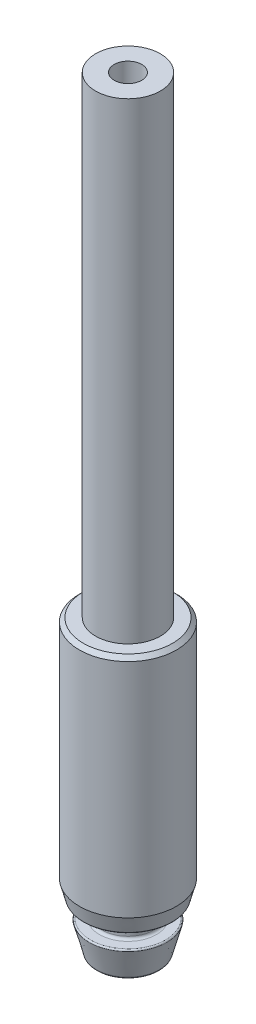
from build123d import *

# Parameters (mm, degrees)
SKETCH12_W                = 3.175
SKETCH12_H                = 46.355
F_6_32_TAPPED_HOLE1_D     = 2.7051
F_6_32_TAPPED_HOLE1_DEPTH = 9.398
F_6_32_TAPPED_HOLE1_TIP   = 0.81269403
CHAMFER2_SIZE             = 0.381
O_RING_EXTERNAL_RADIUS_R  = 0.127
O_RING_INTERNAL_RADIUS_R  = 0.254
FILLET4_R                 = 0.254


with BuildPart() as part:
    # Sketch10 → Revolve1 (revolve)
    with BuildSketch(Plane.XY, mode=Mode.PRIVATE) as revolve1_sk:
        Polygon((4.7625, 6.39860111), (4.7625, 28.575), (0, 28.575), (0, 0), (3.048, 0), align=None)
    revolve(revolve1_sk.sketch.rotate(Axis((0, 0, 0), (0, 1, 0)), 90), axis=Axis((0, 0, 0), (0, 1, 0)))

    # Sketch12 → Revolve2 (revolve)
    with BuildSketch(Plane.XY, mode=Mode.PRIVATE) as revolve2_sk:
        with Locations((1.5875, 51.7525)):
            Rectangle(SKETCH12_W, SKETCH12_H)
    revolve(revolve2_sk.sketch.rotate(Axis((0, 0, 0), (0, 1, 0)), 90), axis=Axis((0, 0, 0), (0, 1, 0)))

    # 6-32 Tapped Hole1
    with Locations(Plane(origin=(0, 74.93, 0), x_dir=(1, 0, 0), z_dir=(0, 1, 0))):
        with Locations((0, 0)):
            Hole(F_6_32_TAPPED_HOLE1_D / 2, depth=F_6_32_TAPPED_HOLE1_DEPTH)
            with Locations((0, 0, -(F_6_32_TAPPED_HOLE1_DEPTH + F_6_32_TAPPED_HOLE1_TIP / 2))):  # 118° drill point
                Cone(0, F_6_32_TAPPED_HOLE1_D / 2, F_6_32_TAPPED_HOLE1_TIP, mode=Mode.SUBTRACT)

    # Chamfer2
    chamfer2_edges = [part.edges().sort_by_distance(p)[0] for p in [
        (0, 28.575, 4.7625),
    ]]
    chamfer(chamfer2_edges, length=CHAMFER2_SIZE)

    # Sketch11 → o-ring_groove (revolve, cut)
    with BuildSketch(Plane.XY, mode=Mode.PRIVATE) as o_ring_groove_sk:
        Polygon((2.541874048, 3.013970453), (3.855590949, 3.013970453), (4.332004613, 4.791970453), (2.541874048, 4.791970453), align=None)
    revolve(o_ring_groove_sk.sketch.rotate(Axis((0, 0, 0), (0, 1, 0)), 90), axis=Axis((0, 0, 0), (0, 1, 0)), mode=Mode.SUBTRACT)

    # o-ring_external_radius
    o_ring_external_radius_edges = [part.edges().sort_by_distance(p)[0] for p in [
        (0, 3.013970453, 3.855590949),
        (0, 4.791970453, 4.332004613),
    ]]
    fillet(o_ring_external_radius_edges, radius=O_RING_EXTERNAL_RADIUS_R)

    # o-ring_internal_radius
    o_ring_internal_radius_edges = [part.edges().sort_by_distance(p)[0] for p in [
        (0, 3.013970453, 2.541874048),
        (0, 4.791970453, 2.541874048),
    ]]
    fillet(o_ring_internal_radius_edges, radius=O_RING_INTERNAL_RADIUS_R)

    # Fillet4
    fillet4_edges = [part.edges().sort_by_distance(p)[0] for p in [
        (0, 0, 3.048),
    ]]
    fillet(fillet4_edges, radius=FILLET4_R)


solid = part.part
